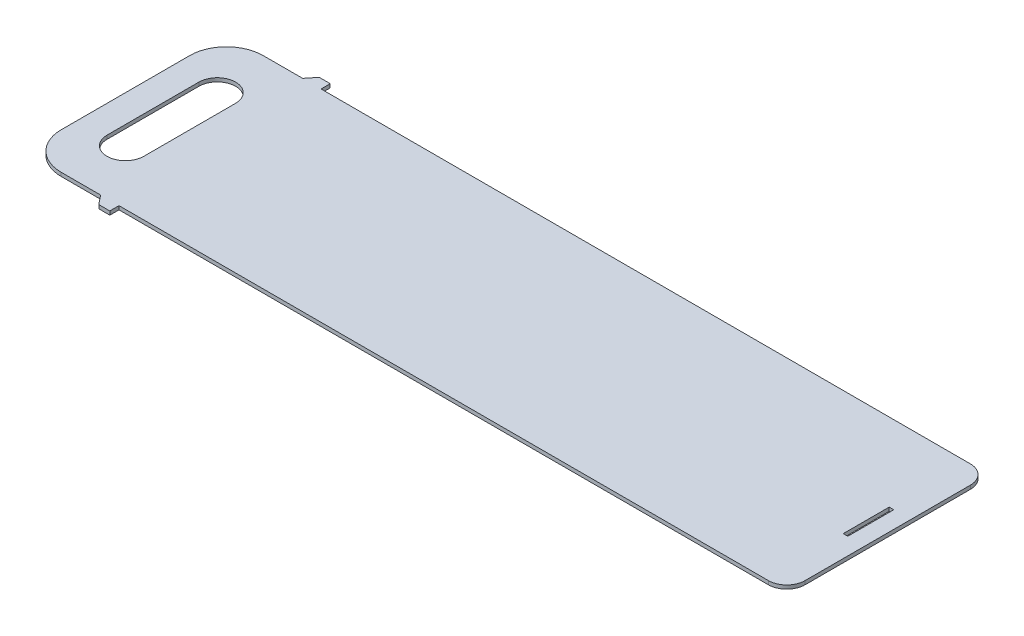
ISO-10303-21;
HEADER;
FILE_DESCRIPTION(('STEP AP214'),'2;1');
FILE_NAME('part.step','',(''),(''),'','','');
FILE_SCHEMA(('AUTOMOTIVE_DESIGN { 1 0 10303 214 1 1 1 1 }'));
ENDSEC;
DATA;
#1=APPLICATION_CONTEXT('core data for automotive mechanical design processes');
#2=APPLICATION_PROTOCOL_DEFINITION('international standard','automotive_design',2000,#1);
#3=PRODUCT_CONTEXT('',#1,'mechanical');
#4=PRODUCT('Part','Part','',(#3));
#5=PRODUCT_RELATED_PRODUCT_CATEGORY('part','',(#4));
#6=PRODUCT_DEFINITION_FORMATION('','',#4);
#7=PRODUCT_DEFINITION_CONTEXT('part definition',#1,'design');
#8=PRODUCT_DEFINITION('design','',#6,#7);
#9=PRODUCT_DEFINITION_SHAPE('','',#8);
#10=(LENGTH_UNIT() NAMED_UNIT(*) SI_UNIT(.MILLI.,.METRE.));
#11=(NAMED_UNIT(*) PLANE_ANGLE_UNIT() SI_UNIT($,.RADIAN.));
#12=(NAMED_UNIT(*) SI_UNIT($,.STERADIAN.) SOLID_ANGLE_UNIT());
#13=UNCERTAINTY_MEASURE_WITH_UNIT(LENGTH_MEASURE(1.E-05),#10,'distance_accuracy_value','');
#14=(GEOMETRIC_REPRESENTATION_CONTEXT(3) GLOBAL_UNCERTAINTY_ASSIGNED_CONTEXT((#13)) GLOBAL_UNIT_ASSIGNED_CONTEXT((#10,
#11,#12)) REPRESENTATION_CONTEXT('',''));
#15=CARTESIAN_POINT('',(0.,0.,0.));
#16=DIRECTION('',(0.,0.,1.));
#17=DIRECTION('',(1.,0.,0.));
#18=AXIS2_PLACEMENT_3D('',#15,#16,#17);
#19=CARTESIAN_POINT('',(0.,-2.,0.));
#20=DIRECTION('',(0.,0.,1.));
#21=DIRECTION('',(1.,0.,0.));
#22=AXIS2_PLACEMENT_3D('',#19,#20,#21);
#23=PLANE('',#22);
#24=DIRECTION('',(0.,1.,0.));
#25=VECTOR('',#24,1.);
#26=CARTESIAN_POINT('',(51.5,-2.,0.));
#27=LINE('',#26,#25);
#28=CARTESIAN_POINT('',(51.5,-2.,0.));
#29=VERTEX_POINT('',#28);
#30=CARTESIAN_POINT('',(51.5,0.,0.));
#31=VERTEX_POINT('',#30);
#32=EDGE_CURVE('E249',#29,#31,#27,.T.);
#33=ORIENTED_EDGE('',*,*,#32,.F.);
#34=DIRECTION('',(1.,0.,0.));
#35=VECTOR('',#34,1.);
#36=CARTESIAN_POINT('',(0.,-2.,0.));
#37=LINE('',#36,#35);
#38=CARTESIAN_POINT('',(405.,-2.,0.));
#39=VERTEX_POINT('',#38);
#40=EDGE_CURVE('E317',#29,#39,#37,.T.);
#41=ORIENTED_EDGE('',*,*,#40,.T.);
#42=DIRECTION('',(0.,1.,0.));
#43=VECTOR('',#42,1.);
#44=CARTESIAN_POINT('',(405.,-2.,0.));
#45=LINE('',#44,#43);
#46=CARTESIAN_POINT('',(405.,0.,0.));
#47=VERTEX_POINT('',#46);
#48=EDGE_CURVE('E355',#39,#47,#45,.T.);
#49=ORIENTED_EDGE('',*,*,#48,.T.);
#50=DIRECTION('',(1.,0.,0.));
#51=VECTOR('',#50,1.);
#52=CARTESIAN_POINT('',(0.,0.,0.));
#53=LINE('',#52,#51);
#54=EDGE_CURVE('E331',#31,#47,#53,.T.);
#55=ORIENTED_EDGE('',*,*,#54,.F.);
#56=EDGE_LOOP('',(#33,#41,#49,#55));
#57=FACE_BOUND('',#56,.T.);
#58=ADVANCED_FACE('F37',(#57),#23,.T.);
#59=CARTESIAN_POINT('',(0.,-2.,-110.));
#60=DIRECTION('',(0.,0.,-1.));
#61=DIRECTION('',(-1.,0.,0.));
#62=AXIS2_PLACEMENT_3D('',#59,#60,#61);
#63=PLANE('',#62);
#64=DIRECTION('',(0.,1.,0.));
#65=VECTOR('',#64,1.);
#66=CARTESIAN_POINT('',(51.5,-2.,-110.));
#67=LINE('',#66,#65);
#68=CARTESIAN_POINT('',(51.5,-2.,-110.));
#69=VERTEX_POINT('',#68);
#70=CARTESIAN_POINT('',(51.5,0.,-110.));
#71=VERTEX_POINT('',#70);
#72=EDGE_CURVE('E278',#69,#71,#67,.T.);
#73=ORIENTED_EDGE('',*,*,#72,.T.);
#74=DIRECTION('',(-1.,0.,0.));
#75=VECTOR('',#74,1.);
#76=CARTESIAN_POINT('',(0.,0.,-110.));
#77=LINE('',#76,#75);
#78=CARTESIAN_POINT('',(405.,0.,-110.));
#79=VERTEX_POINT('',#78);
#80=EDGE_CURVE('E318',#79,#71,#77,.T.);
#81=ORIENTED_EDGE('',*,*,#80,.F.);
#82=DIRECTION('',(0.,1.,0.));
#83=VECTOR('',#82,1.);
#84=CARTESIAN_POINT('',(405.,-2.,-110.));
#85=LINE('',#84,#83);
#86=CARTESIAN_POINT('',(405.,-2.,-110.));
#87=VERTEX_POINT('',#86);
#88=EDGE_CURVE('E348',#79,#87,#85,.F.);
#89=ORIENTED_EDGE('',*,*,#88,.T.);
#90=DIRECTION('',(-1.,0.,0.));
#91=VECTOR('',#90,1.);
#92=CARTESIAN_POINT('',(0.,-2.,-110.));
#93=LINE('',#92,#91);
#94=EDGE_CURVE('E325',#87,#69,#93,.T.);
#95=ORIENTED_EDGE('',*,*,#94,.T.);
#96=EDGE_LOOP('',(#73,#81,#89,#95));
#97=FACE_BOUND('',#96,.T.);
#98=ADVANCED_FACE('F435',(#97),#63,.T.);
#99=CARTESIAN_POINT('',(0.,-2.,0.));
#100=DIRECTION('',(-1.,0.,0.));
#101=DIRECTION('',(0.,0.,1.));
#102=AXIS2_PLACEMENT_3D('',#99,#100,#101);
#103=PLANE('',#102);
#104=DIRECTION('',(0.,0.,1.));
#105=VECTOR('',#104,1.);
#106=CARTESIAN_POINT('',(0.,0.,0.));
#107=LINE('',#106,#105);
#108=CARTESIAN_POINT('',(0.,0.,-90.));
#109=VERTEX_POINT('',#108);
#110=CARTESIAN_POINT('',(0.,0.,-20.));
#111=VERTEX_POINT('',#110);
#112=EDGE_CURVE('E313',#109,#111,#107,.T.);
#113=ORIENTED_EDGE('',*,*,#112,.F.);
#114=DIRECTION('',(0.,1.,0.));
#115=VECTOR('',#114,1.);
#116=CARTESIAN_POINT('',(0.,-2.,-90.));
#117=LINE('',#116,#115);
#118=CARTESIAN_POINT('',(0.,-2.,-90.));
#119=VERTEX_POINT('',#118);
#120=EDGE_CURVE('E368',#109,#119,#117,.F.);
#121=ORIENTED_EDGE('',*,*,#120,.T.);
#122=DIRECTION('',(0.,0.,1.));
#123=VECTOR('',#122,1.);
#124=CARTESIAN_POINT('',(0.,-2.,0.));
#125=LINE('',#124,#123);
#126=CARTESIAN_POINT('',(0.,-2.,-20.));
#127=VERTEX_POINT('',#126);
#128=EDGE_CURVE('E314',#119,#127,#125,.T.);
#129=ORIENTED_EDGE('',*,*,#128,.T.);
#130=DIRECTION('',(0.,1.,0.));
#131=VECTOR('',#130,1.);
#132=CARTESIAN_POINT('',(0.,-2.,-20.));
#133=LINE('',#132,#131);
#134=EDGE_CURVE('E365',#127,#111,#133,.T.);
#135=ORIENTED_EDGE('',*,*,#134,.T.);
#136=EDGE_LOOP('',(#113,#121,#129,#135));
#137=FACE_BOUND('',#136,.T.);
#138=ADVANCED_FACE('F390',(#137),#103,.T.);
#139=CARTESIAN_POINT('',(41.5,-2.,-110.));
#140=VERTEX_POINT('',#139);
#141=CARTESIAN_POINT('',(20.,-2.,-110.));
#142=VERTEX_POINT('',#141);
#143=EDGE_CURVE('E324',#140,#142,#93,.T.);
#144=ORIENTED_EDGE('',*,*,#143,.T.);
#145=DIRECTION('',(0.,1.,0.));
#146=VECTOR('',#145,1.);
#147=CARTESIAN_POINT('',(20.,-2.,-110.));
#148=LINE('',#147,#146);
#149=CARTESIAN_POINT('',(20.,0.,-110.));
#150=VERTEX_POINT('',#149);
#151=EDGE_CURVE('E358',#142,#150,#148,.T.);
#152=ORIENTED_EDGE('',*,*,#151,.T.);
#153=CARTESIAN_POINT('',(41.5,0.,-110.));
#154=VERTEX_POINT('',#153);
#155=EDGE_CURVE('E337',#154,#150,#77,.T.);
#156=ORIENTED_EDGE('',*,*,#155,.F.);
#157=DIRECTION('',(0.,1.,0.));
#158=VECTOR('',#157,1.);
#159=CARTESIAN_POINT('',(41.5,-2.,-110.));
#160=LINE('',#159,#158);
#161=EDGE_CURVE('E281',#140,#154,#160,.T.);
#162=ORIENTED_EDGE('',*,*,#161,.F.);
#163=EDGE_LOOP('',(#144,#152,#156,#162));
#164=FACE_BOUND('',#163,.T.);
#165=ADVANCED_FACE('F383',(#164),#63,.T.);
#166=CARTESIAN_POINT('',(415.,-2.,0.));
#167=DIRECTION('',(1.,0.,0.));
#168=DIRECTION('',(0.,0.,-1.));
#169=AXIS2_PLACEMENT_3D('',#166,#167,#168);
#170=PLANE('',#169);
#171=DIRECTION('',(0.,0.,-1.));
#172=VECTOR('',#171,1.);
#173=CARTESIAN_POINT('',(415.,-2.,0.));
#174=LINE('',#173,#172);
#175=CARTESIAN_POINT('',(415.,-2.,-10.));
#176=VERTEX_POINT('',#175);
#177=CARTESIAN_POINT('',(415.,-2.,-100.));
#178=VERTEX_POINT('',#177);
#179=EDGE_CURVE('E321',#176,#178,#174,.T.);
#180=ORIENTED_EDGE('',*,*,#179,.T.);
#181=DIRECTION('',(0.,1.,0.));
#182=VECTOR('',#181,1.);
#183=CARTESIAN_POINT('',(415.,-2.,-100.));
#184=LINE('',#183,#182);
#185=CARTESIAN_POINT('',(415.,0.,-100.));
#186=VERTEX_POINT('',#185);
#187=EDGE_CURVE('E341',#178,#186,#184,.T.);
#188=ORIENTED_EDGE('',*,*,#187,.T.);
#189=DIRECTION('',(0.,0.,-1.));
#190=VECTOR('',#189,1.);
#191=CARTESIAN_POINT('',(415.,0.,0.));
#192=LINE('',#191,#190);
#193=CARTESIAN_POINT('',(415.,0.,-10.));
#194=VERTEX_POINT('',#193);
#195=EDGE_CURVE('E334',#194,#186,#192,.T.);
#196=ORIENTED_EDGE('',*,*,#195,.F.);
#197=DIRECTION('',(0.,1.,0.));
#198=VECTOR('',#197,1.);
#199=CARTESIAN_POINT('',(415.,-2.,-10.));
#200=LINE('',#199,#198);
#201=EDGE_CURVE('E328',#194,#176,#200,.F.);
#202=ORIENTED_EDGE('',*,*,#201,.T.);
#203=EDGE_LOOP('',(#180,#188,#196,#202));
#204=FACE_BOUND('',#203,.T.);
#205=ADVANCED_FACE('F425',(#204),#170,.T.);
#206=CARTESIAN_POINT('',(20.,0.,0.));
#207=VERTEX_POINT('',#206);
#208=CARTESIAN_POINT('',(41.5,0.,0.));
#209=VERTEX_POINT('',#208);
#210=EDGE_CURVE('E332',#207,#209,#53,.T.);
#211=ORIENTED_EDGE('',*,*,#210,.F.);
#212=DIRECTION('',(0.,1.,0.));
#213=VECTOR('',#212,1.);
#214=CARTESIAN_POINT('',(20.,-2.,0.));
#215=LINE('',#214,#213);
#216=CARTESIAN_POINT('',(20.,-2.,0.));
#217=VERTEX_POINT('',#216);
#218=EDGE_CURVE('E11',#207,#217,#215,.F.);
#219=ORIENTED_EDGE('',*,*,#218,.T.);
#220=CARTESIAN_POINT('',(41.5,-2.,0.));
#221=VERTEX_POINT('',#220);
#222=EDGE_CURVE('E319',#217,#221,#37,.T.);
#223=ORIENTED_EDGE('',*,*,#222,.T.);
#224=DIRECTION('',(0.,1.,0.));
#225=VECTOR('',#224,1.);
#226=CARTESIAN_POINT('',(41.5,-2.,0.));
#227=LINE('',#226,#225);
#228=EDGE_CURVE('E242',#221,#209,#227,.T.);
#229=ORIENTED_EDGE('',*,*,#228,.T.);
#230=EDGE_LOOP('',(#211,#219,#223,#229));
#231=FACE_BOUND('',#230,.T.);
#232=ADVANCED_FACE('F398',(#231),#23,.T.);
#233=CARTESIAN_POINT('',(0.,-2.,0.));
#234=DIRECTION('',(0.,-1.,0.));
#235=DIRECTION('',(0.,0.,-1.));
#236=AXIS2_PLACEMENT_3D('',#233,#234,#235);
#237=PLANE('',#236);
#238=CARTESIAN_POINT('',(25.,-2.,-80.));
#239=DIRECTION('',(0.,-1.,0.));
#240=DIRECTION('',(0.,0.,-1.));
#241=AXIS2_PLACEMENT_3D('',#238,#239,#240);
#242=CIRCLE('',#241,9.99999999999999);
#243=CARTESIAN_POINT('',(15.,-2.,-80.));
#244=VERTEX_POINT('',#243);
#245=CARTESIAN_POINT('',(35.,-2.,-80.));
#246=VERTEX_POINT('',#245);
#247=EDGE_CURVE('E230',#244,#246,#242,.T.);
#248=ORIENTED_EDGE('',*,*,#247,.F.);
#249=DIRECTION('',(0.,0.,-1.));
#250=VECTOR('',#249,1.);
#251=CARTESIAN_POINT('',(15.,-2.,0.));
#252=LINE('',#251,#250);
#253=CARTESIAN_POINT('',(15.,-2.,-30.));
#254=VERTEX_POINT('',#253);
#255=EDGE_CURVE('E223',#254,#244,#252,.T.);
#256=ORIENTED_EDGE('',*,*,#255,.F.);
#257=CARTESIAN_POINT('',(25.,-2.,-30.));
#258=DIRECTION('',(0.,-1.,0.));
#259=DIRECTION('',(0.,0.,-1.));
#260=AXIS2_PLACEMENT_3D('',#257,#258,#259);
#261=CIRCLE('',#260,9.99999999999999);
#262=CARTESIAN_POINT('',(35.,-2.,-30.));
#263=VERTEX_POINT('',#262);
#264=EDGE_CURVE('E203',#263,#254,#261,.T.);
#265=ORIENTED_EDGE('',*,*,#264,.F.);
#266=DIRECTION('',(0.,0.,1.));
#267=VECTOR('',#266,1.);
#268=CARTESIAN_POINT('',(35.,-2.,0.));
#269=LINE('',#268,#267);
#270=EDGE_CURVE('E228',#246,#263,#269,.T.);
#271=ORIENTED_EDGE('',*,*,#270,.F.);
#272=EDGE_LOOP('',(#248,#256,#265,#271));
#273=FACE_BOUND('',#272,.T.);
#274=DIRECTION('',(0.,0.,1.));
#275=VECTOR('',#274,1.);
#276=CARTESIAN_POINT('',(405.75,-2.,0.));
#277=LINE('',#276,#275);
#278=CARTESIAN_POINT('',(405.75,-2.,-67.5));
#279=VERTEX_POINT('',#278);
#280=CARTESIAN_POINT('',(405.75,-2.,-42.5));
#281=VERTEX_POINT('',#280);
#282=EDGE_CURVE('E311',#279,#281,#277,.T.);
#283=ORIENTED_EDGE('',*,*,#282,.F.);
#284=DIRECTION('',(1.,0.,0.));
#285=VECTOR('',#284,1.);
#286=CARTESIAN_POINT('',(0.,-2.,-67.5));
#287=LINE('',#286,#285);
#288=CARTESIAN_POINT('',(403.25,-2.,-67.5));
#289=VERTEX_POINT('',#288);
#290=EDGE_CURVE('E298',#289,#279,#287,.T.);
#291=ORIENTED_EDGE('',*,*,#290,.F.);
#292=DIRECTION('',(0.,0.,-1.));
#293=VECTOR('',#292,1.);
#294=CARTESIAN_POINT('',(403.25,-2.,-8.95394869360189E-13));
#295=LINE('',#294,#293);
#296=CARTESIAN_POINT('',(403.25,-2.,-42.5));
#297=VERTEX_POINT('',#296);
#298=EDGE_CURVE('E306',#297,#289,#295,.T.);
#299=ORIENTED_EDGE('',*,*,#298,.F.);
#300=DIRECTION('',(-1.,0.,0.));
#301=VECTOR('',#300,1.);
#302=CARTESIAN_POINT('',(-1.1796119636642E-13,-2.,-42.4999999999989));
#303=LINE('',#302,#301);
#304=EDGE_CURVE('E309',#281,#297,#303,.T.);
#305=ORIENTED_EDGE('',*,*,#304,.F.);
#306=EDGE_LOOP('',(#283,#291,#299,#305));
#307=FACE_BOUND('',#306,.T.);
#308=ORIENTED_EDGE('',*,*,#128,.F.);
#309=CARTESIAN_POINT('',(20.,-2.,-90.));
#310=DIRECTION('',(0.,-1.,0.));
#311=DIRECTION('',(0.,0.,-1.));
#312=AXIS2_PLACEMENT_3D('',#309,#310,#311);
#313=CIRCLE('',#312,20.);
#314=EDGE_CURVE('E45',#119,#142,#313,.T.);
#315=ORIENTED_EDGE('',*,*,#314,.T.);
#316=ORIENTED_EDGE('',*,*,#143,.F.);
#317=DIRECTION('',(-0.624695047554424,0.,0.78086880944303));
#318=VECTOR('',#317,1.);
#319=CARTESIAN_POINT('',(45.5,-2.,-115.));
#320=LINE('',#319,#318);
#321=CARTESIAN_POINT('',(45.5,-2.,-115.));
#322=VERTEX_POINT('',#321);
#323=EDGE_CURVE('E262',#322,#140,#320,.T.);
#324=ORIENTED_EDGE('',*,*,#323,.F.);
#325=DIRECTION('',(-1.,0.,0.));
#326=VECTOR('',#325,1.);
#327=CARTESIAN_POINT('',(51.5,-2.,-115.));
#328=LINE('',#327,#326);
#329=CARTESIAN_POINT('',(51.5,-2.,-115.));
#330=VERTEX_POINT('',#329);
#331=EDGE_CURVE('E259',#330,#322,#328,.T.);
#332=ORIENTED_EDGE('',*,*,#331,.F.);
#333=DIRECTION('',(0.,0.,-1.));
#334=VECTOR('',#333,1.);
#335=CARTESIAN_POINT('',(51.5,-2.,-110.));
#336=LINE('',#335,#334);
#337=EDGE_CURVE('E265',#69,#330,#336,.T.);
#338=ORIENTED_EDGE('',*,*,#337,.F.);
#339=ORIENTED_EDGE('',*,*,#94,.F.);
#340=CARTESIAN_POINT('',(405.,-2.,-100.));
#341=DIRECTION('',(0.,-1.,0.));
#342=DIRECTION('',(0.,0.,-1.));
#343=AXIS2_PLACEMENT_3D('',#340,#341,#342);
#344=CIRCLE('',#343,10.);
#345=EDGE_CURVE('E353',#87,#178,#344,.T.);
#346=ORIENTED_EDGE('',*,*,#345,.T.);
#347=ORIENTED_EDGE('',*,*,#179,.F.);
#348=CARTESIAN_POINT('',(405.,-2.,-10.));
#349=DIRECTION('',(0.,-1.,0.));
#350=DIRECTION('',(0.,0.,-1.));
#351=AXIS2_PLACEMENT_3D('',#348,#349,#350);
#352=CIRCLE('',#351,10.);
#353=EDGE_CURVE('E350',#176,#39,#352,.T.);
#354=ORIENTED_EDGE('',*,*,#353,.T.);
#355=ORIENTED_EDGE('',*,*,#40,.F.);
#356=DIRECTION('',(0.,0.,-1.));
#357=VECTOR('',#356,1.);
#358=CARTESIAN_POINT('',(51.5,-2.,0.));
#359=LINE('',#358,#357);
#360=CARTESIAN_POINT('',(51.5,-2.,5.));
#361=VERTEX_POINT('',#360);
#362=EDGE_CURVE('E240',#361,#29,#359,.T.);
#363=ORIENTED_EDGE('',*,*,#362,.F.);
#364=DIRECTION('',(1.,0.,0.));
#365=VECTOR('',#364,1.);
#366=CARTESIAN_POINT('',(51.5,-2.,5.));
#367=LINE('',#366,#365);
#368=CARTESIAN_POINT('',(45.5,-2.,5.));
#369=VERTEX_POINT('',#368);
#370=EDGE_CURVE('E236',#369,#361,#367,.T.);
#371=ORIENTED_EDGE('',*,*,#370,.F.);
#372=DIRECTION('',(0.624695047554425,0.,0.78086880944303));
#373=VECTOR('',#372,1.);
#374=CARTESIAN_POINT('',(45.5,-2.,5.));
#375=LINE('',#374,#373);
#376=EDGE_CURVE('E233',#221,#369,#375,.T.);
#377=ORIENTED_EDGE('',*,*,#376,.F.);
#378=ORIENTED_EDGE('',*,*,#222,.F.);
#379=CARTESIAN_POINT('',(20.,-2.,-20.));
#380=DIRECTION('',(0.,-1.,0.));
#381=DIRECTION('',(0.,0.,-1.));
#382=AXIS2_PLACEMENT_3D('',#379,#380,#381);
#383=CIRCLE('',#382,20.);
#384=EDGE_CURVE('E370',#217,#127,#383,.T.);
#385=ORIENTED_EDGE('',*,*,#384,.T.);
#386=EDGE_LOOP('',(#308,#315,#316,#324,#332,#338,#339,#346,#347,#354,#355,#363,#371,#377,#378,#385));
#387=FACE_BOUND('',#386,.T.);
#388=ADVANCED_FACE('F376',(#273,#307,#387),#237,.T.);
#389=CARTESIAN_POINT('',(0.,0.,0.));
#390=DIRECTION('',(0.,-1.,0.));
#391=DIRECTION('',(0.,0.,-1.));
#392=AXIS2_PLACEMENT_3D('',#389,#390,#391);
#393=PLANE('',#392);
#394=DIRECTION('',(0.,0.,1.));
#395=VECTOR('',#394,1.);
#396=CARTESIAN_POINT('',(15.,0.,-80.));
#397=LINE('',#396,#395);
#398=CARTESIAN_POINT('',(15.,0.,-80.));
#399=VERTEX_POINT('',#398);
#400=CARTESIAN_POINT('',(15.,0.,-30.));
#401=VERTEX_POINT('',#400);
#402=EDGE_CURVE('E209',#399,#401,#397,.T.);
#403=ORIENTED_EDGE('',*,*,#402,.F.);
#404=CARTESIAN_POINT('',(25.,0.,-80.));
#405=DIRECTION('',(0.,1.,0.));
#406=DIRECTION('',(0.,0.,1.));
#407=AXIS2_PLACEMENT_3D('',#404,#405,#406);
#408=CIRCLE('',#407,9.99999999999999);
#409=CARTESIAN_POINT('',(35.,0.,-80.));
#410=VERTEX_POINT('',#409);
#411=EDGE_CURVE('E60',#410,#399,#408,.T.);
#412=ORIENTED_EDGE('',*,*,#411,.F.);
#413=DIRECTION('',(0.,0.,-1.));
#414=VECTOR('',#413,1.);
#415=CARTESIAN_POINT('',(35.,0.,-80.));
#416=LINE('',#415,#414);
#417=CARTESIAN_POINT('',(35.,0.,-30.));
#418=VERTEX_POINT('',#417);
#419=EDGE_CURVE('E216',#418,#410,#416,.T.);
#420=ORIENTED_EDGE('',*,*,#419,.F.);
#421=CARTESIAN_POINT('',(25.,0.,-30.));
#422=DIRECTION('',(0.,1.,0.));
#423=DIRECTION('',(0.,0.,1.));
#424=AXIS2_PLACEMENT_3D('',#421,#422,#423);
#425=CIRCLE('',#424,9.99999999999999);
#426=EDGE_CURVE('E200',#401,#418,#425,.T.);
#427=ORIENTED_EDGE('',*,*,#426,.F.);
#428=EDGE_LOOP('',(#403,#412,#420,#427));
#429=FACE_BOUND('',#428,.T.);
#430=DIRECTION('',(-1.,0.,0.));
#431=VECTOR('',#430,1.);
#432=CARTESIAN_POINT('',(405.75,0.,-67.5));
#433=LINE('',#432,#431);
#434=CARTESIAN_POINT('',(405.75,0.,-67.5));
#435=VERTEX_POINT('',#434);
#436=CARTESIAN_POINT('',(403.25,0.,-67.5));
#437=VERTEX_POINT('',#436);
#438=EDGE_CURVE('E286',#435,#437,#433,.T.);
#439=ORIENTED_EDGE('',*,*,#438,.F.);
#440=DIRECTION('',(0.,0.,-1.));
#441=VECTOR('',#440,1.);
#442=CARTESIAN_POINT('',(405.75,0.,-67.5));
#443=LINE('',#442,#441);
#444=CARTESIAN_POINT('',(405.75,0.,-42.5));
#445=VERTEX_POINT('',#444);
#446=EDGE_CURVE('E277',#445,#435,#443,.T.);
#447=ORIENTED_EDGE('',*,*,#446,.F.);
#448=DIRECTION('',(1.,0.,0.));
#449=VECTOR('',#448,1.);
#450=CARTESIAN_POINT('',(405.75,0.,-42.5));
#451=LINE('',#450,#449);
#452=CARTESIAN_POINT('',(403.25,0.,-42.5));
#453=VERTEX_POINT('',#452);
#454=EDGE_CURVE('E292',#453,#445,#451,.T.);
#455=ORIENTED_EDGE('',*,*,#454,.F.);
#456=DIRECTION('',(0.,0.,1.));
#457=VECTOR('',#456,1.);
#458=CARTESIAN_POINT('',(403.25,0.,-67.5));
#459=LINE('',#458,#457);
#460=EDGE_CURVE('E289',#437,#453,#459,.T.);
#461=ORIENTED_EDGE('',*,*,#460,.F.);
#462=EDGE_LOOP('',(#439,#447,#455,#461));
#463=FACE_BOUND('',#462,.T.);
#464=ORIENTED_EDGE('',*,*,#155,.T.);
#465=CARTESIAN_POINT('',(20.,0.,-90.));
#466=DIRECTION('',(0.,-1.,0.));
#467=DIRECTION('',(0.,0.,-1.));
#468=AXIS2_PLACEMENT_3D('',#465,#466,#467);
#469=CIRCLE('',#468,20.);
#470=EDGE_CURVE('E363',#150,#109,#469,.F.);
#471=ORIENTED_EDGE('',*,*,#470,.T.);
#472=ORIENTED_EDGE('',*,*,#112,.T.);
#473=CARTESIAN_POINT('',(20.,0.,-20.));
#474=DIRECTION('',(0.,-1.,0.));
#475=DIRECTION('',(0.,0.,-1.));
#476=AXIS2_PLACEMENT_3D('',#473,#474,#475);
#477=CIRCLE('',#476,20.);
#478=EDGE_CURVE('E361',#111,#207,#477,.F.);
#479=ORIENTED_EDGE('',*,*,#478,.T.);
#480=ORIENTED_EDGE('',*,*,#210,.T.);
#481=DIRECTION('',(0.624695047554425,0.,0.78086880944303));
#482=VECTOR('',#481,1.);
#483=CARTESIAN_POINT('',(45.5,0.,5.));
#484=LINE('',#483,#482);
#485=CARTESIAN_POINT('',(45.5,0.,5.));
#486=VERTEX_POINT('',#485);
#487=EDGE_CURVE('E232',#209,#486,#484,.T.);
#488=ORIENTED_EDGE('',*,*,#487,.T.);
#489=DIRECTION('',(1.,0.,0.));
#490=VECTOR('',#489,1.);
#491=CARTESIAN_POINT('',(51.5,0.,5.));
#492=LINE('',#491,#490);
#493=CARTESIAN_POINT('',(51.5,0.,5.));
#494=VERTEX_POINT('',#493);
#495=EDGE_CURVE('E245',#486,#494,#492,.T.);
#496=ORIENTED_EDGE('',*,*,#495,.T.);
#497=DIRECTION('',(0.,0.,-1.));
#498=VECTOR('',#497,1.);
#499=CARTESIAN_POINT('',(51.5,0.,0.));
#500=LINE('',#499,#498);
#501=EDGE_CURVE('E237',#494,#31,#500,.T.);
#502=ORIENTED_EDGE('',*,*,#501,.T.);
#503=ORIENTED_EDGE('',*,*,#54,.T.);
#504=CARTESIAN_POINT('',(405.,0.,-10.));
#505=DIRECTION('',(0.,-1.,0.));
#506=DIRECTION('',(0.,0.,-1.));
#507=AXIS2_PLACEMENT_3D('',#504,#505,#506);
#508=CIRCLE('',#507,10.);
#509=EDGE_CURVE('E344',#47,#194,#508,.F.);
#510=ORIENTED_EDGE('',*,*,#509,.T.);
#511=ORIENTED_EDGE('',*,*,#195,.T.);
#512=CARTESIAN_POINT('',(405.,0.,-100.));
#513=DIRECTION('',(0.,-1.,0.));
#514=DIRECTION('',(0.,0.,-1.));
#515=AXIS2_PLACEMENT_3D('',#512,#513,#514);
#516=CIRCLE('',#515,10.);
#517=EDGE_CURVE('E346',#186,#79,#516,.F.);
#518=ORIENTED_EDGE('',*,*,#517,.T.);
#519=ORIENTED_EDGE('',*,*,#80,.T.);
#520=DIRECTION('',(0.,0.,-1.));
#521=VECTOR('',#520,1.);
#522=CARTESIAN_POINT('',(51.5,0.,-110.));
#523=LINE('',#522,#521);
#524=CARTESIAN_POINT('',(51.5,0.,-115.));
#525=VERTEX_POINT('',#524);
#526=EDGE_CURVE('E263',#71,#525,#523,.T.);
#527=ORIENTED_EDGE('',*,*,#526,.T.);
#528=DIRECTION('',(-1.,0.,0.));
#529=VECTOR('',#528,1.);
#530=CARTESIAN_POINT('',(51.5,0.,-115.));
#531=LINE('',#530,#529);
#532=CARTESIAN_POINT('',(45.5,0.,-115.));
#533=VERTEX_POINT('',#532);
#534=EDGE_CURVE('E252',#525,#533,#531,.T.);
#535=ORIENTED_EDGE('',*,*,#534,.T.);
#536=DIRECTION('',(-0.624695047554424,0.,0.78086880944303));
#537=VECTOR('',#536,1.);
#538=CARTESIAN_POINT('',(45.5,0.,-115.));
#539=LINE('',#538,#537);
#540=EDGE_CURVE('E271',#533,#154,#539,.T.);
#541=ORIENTED_EDGE('',*,*,#540,.T.);
#542=EDGE_LOOP('',(#464,#471,#472,#479,#480,#488,#496,#502,#503,#510,#511,#518,#519,#527,#535,#541));
#543=FACE_BOUND('',#542,.T.);
#544=ADVANCED_FACE('F213',(#429,#463,#543),#393,.F.);
#545=CARTESIAN_POINT('',(405.,-2.,-100.));
#546=DIRECTION('',(0.,1.,0.));
#547=DIRECTION('',(0.,0.,1.));
#548=AXIS2_PLACEMENT_3D('',#545,#546,#547);
#549=CYLINDRICAL_SURFACE('',#548,10.);
#550=ORIENTED_EDGE('',*,*,#345,.F.);
#551=ORIENTED_EDGE('',*,*,#88,.F.);
#552=ORIENTED_EDGE('',*,*,#517,.F.);
#553=ORIENTED_EDGE('',*,*,#187,.F.);
#554=EDGE_LOOP('',(#550,#551,#552,#553));
#555=FACE_BOUND('',#554,.T.);
#556=ADVANCED_FACE('F432',(#555),#549,.T.);
#557=CARTESIAN_POINT('',(405.,-2.,-10.));
#558=DIRECTION('',(0.,1.,0.));
#559=DIRECTION('',(0.,0.,1.));
#560=AXIS2_PLACEMENT_3D('',#557,#558,#559);
#561=CYLINDRICAL_SURFACE('',#560,10.);
#562=ORIENTED_EDGE('',*,*,#353,.F.);
#563=ORIENTED_EDGE('',*,*,#201,.F.);
#564=ORIENTED_EDGE('',*,*,#509,.F.);
#565=ORIENTED_EDGE('',*,*,#48,.F.);
#566=EDGE_LOOP('',(#562,#563,#564,#565));
#567=FACE_BOUND('',#566,.T.);
#568=ADVANCED_FACE('F422',(#567),#561,.T.);
#569=CARTESIAN_POINT('',(405.75,-10.,-67.5));
#570=DIRECTION('',(1.,0.,0.));
#571=DIRECTION('',(0.,0.,-1.));
#572=AXIS2_PLACEMENT_3D('',#569,#570,#571);
#573=PLANE('',#572);
#574=ORIENTED_EDGE('',*,*,#282,.T.);
#575=DIRECTION('',(0.,1.,0.));
#576=VECTOR('',#575,1.);
#577=CARTESIAN_POINT('',(405.75,-10.,-42.5));
#578=LINE('',#577,#576);
#579=EDGE_CURVE('E296',#281,#445,#578,.T.);
#580=ORIENTED_EDGE('',*,*,#579,.T.);
#581=ORIENTED_EDGE('',*,*,#446,.T.);
#582=DIRECTION('',(0.,1.,0.));
#583=VECTOR('',#582,1.);
#584=CARTESIAN_POINT('',(405.75,-10.,-67.5));
#585=LINE('',#584,#583);
#586=EDGE_CURVE('E295',#279,#435,#585,.T.);
#587=ORIENTED_EDGE('',*,*,#586,.F.);
#588=EDGE_LOOP('',(#574,#580,#581,#587));
#589=FACE_BOUND('',#588,.T.);
#590=ADVANCED_FACE('F475',(#589),#573,.F.);
#591=CARTESIAN_POINT('',(405.75,-10.,-42.5));
#592=DIRECTION('',(0.,0.,1.));
#593=DIRECTION('',(1.,0.,0.));
#594=AXIS2_PLACEMENT_3D('',#591,#592,#593);
#595=PLANE('',#594);
#596=ORIENTED_EDGE('',*,*,#304,.T.);
#597=DIRECTION('',(0.,1.,0.));
#598=VECTOR('',#597,1.);
#599=CARTESIAN_POINT('',(403.25,-10.,-42.5));
#600=LINE('',#599,#598);
#601=EDGE_CURVE('E299',#297,#453,#600,.T.);
#602=ORIENTED_EDGE('',*,*,#601,.T.);
#603=ORIENTED_EDGE('',*,*,#454,.T.);
#604=ORIENTED_EDGE('',*,*,#579,.F.);
#605=EDGE_LOOP('',(#596,#602,#603,#604));
#606=FACE_BOUND('',#605,.T.);
#607=ADVANCED_FACE('F478',(#606),#595,.F.);
#608=CARTESIAN_POINT('',(403.25,-10.,-67.5));
#609=DIRECTION('',(-1.,0.,0.));
#610=DIRECTION('',(0.,0.,1.));
#611=AXIS2_PLACEMENT_3D('',#608,#609,#610);
#612=PLANE('',#611);
#613=ORIENTED_EDGE('',*,*,#298,.T.);
#614=DIRECTION('',(0.,1.,0.));
#615=VECTOR('',#614,1.);
#616=CARTESIAN_POINT('',(403.25,-10.,-67.5));
#617=LINE('',#616,#615);
#618=EDGE_CURVE('E301',#289,#437,#617,.T.);
#619=ORIENTED_EDGE('',*,*,#618,.T.);
#620=ORIENTED_EDGE('',*,*,#460,.T.);
#621=ORIENTED_EDGE('',*,*,#601,.F.);
#622=EDGE_LOOP('',(#613,#619,#620,#621));
#623=FACE_BOUND('',#622,.T.);
#624=ADVANCED_FACE('F483',(#623),#612,.F.);
#625=CARTESIAN_POINT('',(405.75,-10.,-67.5));
#626=DIRECTION('',(0.,0.,-1.));
#627=DIRECTION('',(-1.,0.,0.));
#628=AXIS2_PLACEMENT_3D('',#625,#626,#627);
#629=PLANE('',#628);
#630=ORIENTED_EDGE('',*,*,#290,.T.);
#631=ORIENTED_EDGE('',*,*,#586,.T.);
#632=ORIENTED_EDGE('',*,*,#438,.T.);
#633=ORIENTED_EDGE('',*,*,#618,.F.);
#634=EDGE_LOOP('',(#630,#631,#632,#633));
#635=FACE_BOUND('',#634,.T.);
#636=ADVANCED_FACE('F480',(#635),#629,.F.);
#637=CARTESIAN_POINT('',(51.5,-2.,-115.));
#638=DIRECTION('',(0.,0.,-1.));
#639=DIRECTION('',(-1.,0.,0.));
#640=AXIS2_PLACEMENT_3D('',#637,#638,#639);
#641=PLANE('',#640);
#642=ORIENTED_EDGE('',*,*,#534,.F.);
#643=DIRECTION('',(0.,1.,0.));
#644=VECTOR('',#643,1.);
#645=CARTESIAN_POINT('',(51.5,-2.,-115.));
#646=LINE('',#645,#644);
#647=EDGE_CURVE('E275',#330,#525,#646,.T.);
#648=ORIENTED_EDGE('',*,*,#647,.F.);
#649=ORIENTED_EDGE('',*,*,#331,.T.);
#650=DIRECTION('',(0.,1.,0.));
#651=VECTOR('',#650,1.);
#652=CARTESIAN_POINT('',(45.5,-2.,-115.));
#653=LINE('',#652,#651);
#654=EDGE_CURVE('E268',#322,#533,#653,.T.);
#655=ORIENTED_EDGE('',*,*,#654,.T.);
#656=EDGE_LOOP('',(#642,#648,#649,#655));
#657=FACE_BOUND('',#656,.T.);
#658=ADVANCED_FACE('F441',(#657),#641,.T.);
#659=CARTESIAN_POINT('',(51.5,-2.,-110.));
#660=DIRECTION('',(1.,0.,0.));
#661=DIRECTION('',(0.,0.,-1.));
#662=AXIS2_PLACEMENT_3D('',#659,#660,#661);
#663=PLANE('',#662);
#664=ORIENTED_EDGE('',*,*,#526,.F.);
#665=ORIENTED_EDGE('',*,*,#72,.F.);
#666=ORIENTED_EDGE('',*,*,#337,.T.);
#667=ORIENTED_EDGE('',*,*,#647,.T.);
#668=EDGE_LOOP('',(#664,#665,#666,#667));
#669=FACE_BOUND('',#668,.T.);
#670=ADVANCED_FACE('F437',(#669),#663,.T.);
#671=CARTESIAN_POINT('',(45.5,-2.,-115.));
#672=DIRECTION('',(-0.78086880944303,0.,-0.624695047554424));
#673=DIRECTION('',(-0.624695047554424,0.,0.78086880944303));
#674=AXIS2_PLACEMENT_3D('',#671,#672,#673);
#675=PLANE('',#674);
#676=ORIENTED_EDGE('',*,*,#540,.F.);
#677=ORIENTED_EDGE('',*,*,#654,.F.);
#678=ORIENTED_EDGE('',*,*,#323,.T.);
#679=ORIENTED_EDGE('',*,*,#161,.T.);
#680=EDGE_LOOP('',(#676,#677,#678,#679));
#681=FACE_BOUND('',#680,.T.);
#682=ADVANCED_FACE('F444',(#681),#675,.T.);
#683=CARTESIAN_POINT('',(51.5,-2.,0.));
#684=DIRECTION('',(1.,0.,0.));
#685=DIRECTION('',(0.,0.,-1.));
#686=AXIS2_PLACEMENT_3D('',#683,#684,#685);
#687=PLANE('',#686);
#688=ORIENTED_EDGE('',*,*,#501,.F.);
#689=DIRECTION('',(0.,1.,0.));
#690=VECTOR('',#689,1.);
#691=CARTESIAN_POINT('',(51.5,-2.,5.));
#692=LINE('',#691,#690);
#693=EDGE_CURVE('E253',#361,#494,#692,.T.);
#694=ORIENTED_EDGE('',*,*,#693,.F.);
#695=ORIENTED_EDGE('',*,*,#362,.T.);
#696=ORIENTED_EDGE('',*,*,#32,.T.);
#697=EDGE_LOOP('',(#688,#694,#695,#696));
#698=FACE_BOUND('',#697,.T.);
#699=ADVANCED_FACE('F412',(#698),#687,.T.);
#700=CARTESIAN_POINT('',(51.5,-2.,5.));
#701=DIRECTION('',(0.,0.,1.));
#702=DIRECTION('',(1.,0.,0.));
#703=AXIS2_PLACEMENT_3D('',#700,#701,#702);
#704=PLANE('',#703);
#705=ORIENTED_EDGE('',*,*,#495,.F.);
#706=DIRECTION('',(0.,1.,0.));
#707=VECTOR('',#706,1.);
#708=CARTESIAN_POINT('',(45.5,-2.,5.));
#709=LINE('',#708,#707);
#710=EDGE_CURVE('E255',#369,#486,#709,.T.);
#711=ORIENTED_EDGE('',*,*,#710,.F.);
#712=ORIENTED_EDGE('',*,*,#370,.T.);
#713=ORIENTED_EDGE('',*,*,#693,.T.);
#714=EDGE_LOOP('',(#705,#711,#712,#713));
#715=FACE_BOUND('',#714,.T.);
#716=ADVANCED_FACE('F409',(#715),#704,.T.);
#717=CARTESIAN_POINT('',(45.5,-2.,5.));
#718=DIRECTION('',(-0.78086880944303,0.,0.624695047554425));
#719=DIRECTION('',(0.624695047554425,0.,0.78086880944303));
#720=AXIS2_PLACEMENT_3D('',#717,#718,#719);
#721=PLANE('',#720);
#722=ORIENTED_EDGE('',*,*,#487,.F.);
#723=ORIENTED_EDGE('',*,*,#228,.F.);
#724=ORIENTED_EDGE('',*,*,#376,.T.);
#725=ORIENTED_EDGE('',*,*,#710,.T.);
#726=EDGE_LOOP('',(#722,#723,#724,#725));
#727=FACE_BOUND('',#726,.T.);
#728=ADVANCED_FACE('F403',(#727),#721,.T.);
#729=CARTESIAN_POINT('',(20.,-2.,-90.));
#730=DIRECTION('',(0.,1.,0.));
#731=DIRECTION('',(0.,0.,1.));
#732=AXIS2_PLACEMENT_3D('',#729,#730,#731);
#733=CYLINDRICAL_SURFACE('',#732,20.);
#734=ORIENTED_EDGE('',*,*,#314,.F.);
#735=ORIENTED_EDGE('',*,*,#120,.F.);
#736=ORIENTED_EDGE('',*,*,#470,.F.);
#737=ORIENTED_EDGE('',*,*,#151,.F.);
#738=EDGE_LOOP('',(#734,#735,#736,#737));
#739=FACE_BOUND('',#738,.T.);
#740=ADVANCED_FACE('F386',(#739),#733,.T.);
#741=CARTESIAN_POINT('',(20.,-2.,-20.));
#742=DIRECTION('',(0.,1.,0.));
#743=DIRECTION('',(0.,0.,1.));
#744=AXIS2_PLACEMENT_3D('',#741,#742,#743);
#745=CYLINDRICAL_SURFACE('',#744,20.);
#746=ORIENTED_EDGE('',*,*,#384,.F.);
#747=ORIENTED_EDGE('',*,*,#218,.F.);
#748=ORIENTED_EDGE('',*,*,#478,.F.);
#749=ORIENTED_EDGE('',*,*,#134,.F.);
#750=EDGE_LOOP('',(#746,#747,#748,#749));
#751=FACE_BOUND('',#750,.T.);
#752=ADVANCED_FACE('F39',(#751),#745,.T.);
#753=CARTESIAN_POINT('',(25.,-10.,-80.));
#754=DIRECTION('',(0.,1.,0.));
#755=DIRECTION('',(0.,0.,1.));
#756=AXIS2_PLACEMENT_3D('',#753,#754,#755);
#757=CYLINDRICAL_SURFACE('',#756,9.99999999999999);
#758=ORIENTED_EDGE('',*,*,#247,.T.);
#759=DIRECTION('',(0.,1.,0.));
#760=VECTOR('',#759,1.);
#761=CARTESIAN_POINT('',(35.,-10.,-80.));
#762=LINE('',#761,#760);
#763=EDGE_CURVE('E221',#246,#410,#762,.T.);
#764=ORIENTED_EDGE('',*,*,#763,.T.);
#765=ORIENTED_EDGE('',*,*,#411,.T.);
#766=DIRECTION('',(0.,1.,0.));
#767=VECTOR('',#766,1.);
#768=CARTESIAN_POINT('',(15.,-10.,-80.));
#769=LINE('',#768,#767);
#770=EDGE_CURVE('E206',#244,#399,#769,.T.);
#771=ORIENTED_EDGE('',*,*,#770,.F.);
#772=EDGE_LOOP('',(#758,#764,#765,#771));
#773=FACE_BOUND('',#772,.T.);
#774=ADVANCED_FACE('F569',(#773),#757,.F.);
#775=CARTESIAN_POINT('',(35.,-10.,-80.));
#776=DIRECTION('',(1.,0.,0.));
#777=DIRECTION('',(0.,0.,-1.));
#778=AXIS2_PLACEMENT_3D('',#775,#776,#777);
#779=PLANE('',#778);
#780=ORIENTED_EDGE('',*,*,#270,.T.);
#781=DIRECTION('',(0.,1.,0.));
#782=VECTOR('',#781,1.);
#783=CARTESIAN_POINT('',(35.,-10.,-30.));
#784=LINE('',#783,#782);
#785=EDGE_CURVE('E205',#263,#418,#784,.T.);
#786=ORIENTED_EDGE('',*,*,#785,.T.);
#787=ORIENTED_EDGE('',*,*,#419,.T.);
#788=ORIENTED_EDGE('',*,*,#763,.F.);
#789=EDGE_LOOP('',(#780,#786,#787,#788));
#790=FACE_BOUND('',#789,.T.);
#791=ADVANCED_FACE('F592',(#790),#779,.F.);
#792=CARTESIAN_POINT('',(25.,-10.,-30.));
#793=DIRECTION('',(0.,1.,0.));
#794=DIRECTION('',(0.,0.,1.));
#795=AXIS2_PLACEMENT_3D('',#792,#793,#794);
#796=CYLINDRICAL_SURFACE('',#795,9.99999999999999);
#797=ORIENTED_EDGE('',*,*,#264,.T.);
#798=DIRECTION('',(0.,1.,0.));
#799=VECTOR('',#798,1.);
#800=CARTESIAN_POINT('',(15.,-10.,-30.));
#801=LINE('',#800,#799);
#802=EDGE_CURVE('E52',#254,#401,#801,.T.);
#803=ORIENTED_EDGE('',*,*,#802,.T.);
#804=ORIENTED_EDGE('',*,*,#426,.T.);
#805=ORIENTED_EDGE('',*,*,#785,.F.);
#806=EDGE_LOOP('',(#797,#803,#804,#805));
#807=FACE_BOUND('',#806,.T.);
#808=ADVANCED_FACE('F197',(#807),#796,.F.);
#809=CARTESIAN_POINT('',(15.,-10.,-80.));
#810=DIRECTION('',(-1.,0.,0.));
#811=DIRECTION('',(0.,0.,1.));
#812=AXIS2_PLACEMENT_3D('',#809,#810,#811);
#813=PLANE('',#812);
#814=ORIENTED_EDGE('',*,*,#255,.T.);
#815=ORIENTED_EDGE('',*,*,#770,.T.);
#816=ORIENTED_EDGE('',*,*,#402,.T.);
#817=ORIENTED_EDGE('',*,*,#802,.F.);
#818=EDGE_LOOP('',(#814,#815,#816,#817));
#819=FACE_BOUND('',#818,.T.);
#820=ADVANCED_FACE('F210',(#819),#813,.F.);
#821=CLOSED_SHELL('',(#58,#98,#138,#165,#205,#232,#388,#544,#556,#568,#590,#607,#624,#636,#658,
#670,#682,#699,#716,#728,#740,#752,#774,#791,#808,#820));
#822=MANIFOLD_SOLID_BREP('B2',#821);
#823=ADVANCED_BREP_SHAPE_REPRESENTATION('',(#18,#822),#14);
#824=SHAPE_DEFINITION_REPRESENTATION(#9,#823);
ENDSEC;
END-ISO-10303-21;
